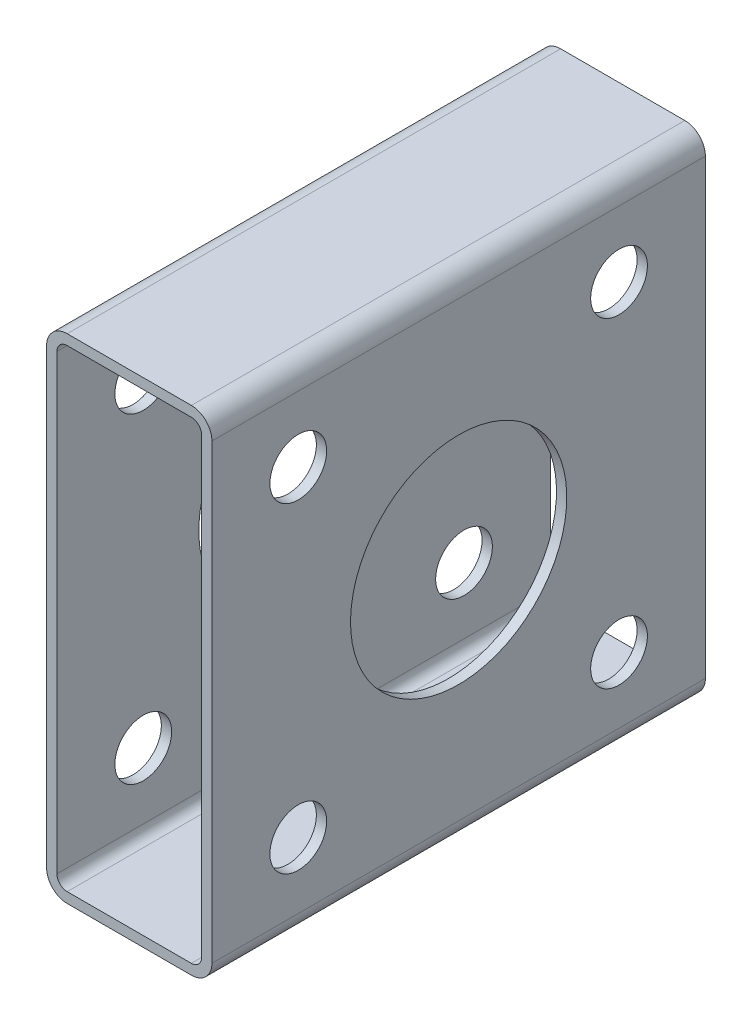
ISO-10303-21;
HEADER;
FILE_DESCRIPTION(('STEP AP214'),'2;1');
FILE_NAME('part.step','',(''),(''),'','','');
FILE_SCHEMA(('AUTOMOTIVE_DESIGN { 1 0 10303 214 1 1 1 1 }'));
ENDSEC;
DATA;
#1=APPLICATION_CONTEXT('core data for automotive mechanical design processes');
#2=APPLICATION_PROTOCOL_DEFINITION('international standard','automotive_design',2000,#1);
#3=PRODUCT_CONTEXT('',#1,'mechanical');
#4=PRODUCT('Part','Part','',(#3));
#5=PRODUCT_RELATED_PRODUCT_CATEGORY('part','',(#4));
#6=PRODUCT_DEFINITION_FORMATION('','',#4);
#7=PRODUCT_DEFINITION_CONTEXT('part definition',#1,'design');
#8=PRODUCT_DEFINITION('design','',#6,#7);
#9=PRODUCT_DEFINITION_SHAPE('','',#8);
#10=(LENGTH_UNIT() NAMED_UNIT(*) SI_UNIT(.MILLI.,.METRE.));
#11=(NAMED_UNIT(*) PLANE_ANGLE_UNIT() SI_UNIT($,.RADIAN.));
#12=(NAMED_UNIT(*) SI_UNIT($,.STERADIAN.) SOLID_ANGLE_UNIT());
#13=UNCERTAINTY_MEASURE_WITH_UNIT(LENGTH_MEASURE(1.E-05),#10,'distance_accuracy_value','');
#14=(GEOMETRIC_REPRESENTATION_CONTEXT(3) GLOBAL_UNCERTAINTY_ASSIGNED_CONTEXT((#13)) GLOBAL_UNIT_ASSIGNED_CONTEXT((#10,
#11,#12)) REPRESENTATION_CONTEXT('',''));
#15=CARTESIAN_POINT('',(0.,0.,0.));
#16=DIRECTION('',(0.,0.,1.));
#17=DIRECTION('',(1.,0.,0.));
#18=AXIS2_PLACEMENT_3D('',#15,#16,#17);
#19=CARTESIAN_POINT('',(-31.75,-69.85,152.4));
#20=DIRECTION('',(0.,0.,1.));
#21=DIRECTION('',(1.,0.,0.));
#22=AXIS2_PLACEMENT_3D('',#19,#20,#21);
#23=PLANE('',#22);
#24=CARTESIAN_POINT('',(-31.75,-69.85,152.4));
#25=DIRECTION('',(0.,0.,1.));
#26=DIRECTION('',(1.,0.,0.));
#27=AXIS2_PLACEMENT_3D('',#24,#25,#26);
#28=CIRCLE('',#27,6.35);
#29=CARTESIAN_POINT('',(-38.1,-69.85,152.4));
#30=VERTEX_POINT('',#29);
#31=CARTESIAN_POINT('',(-31.75,-76.2,152.4));
#32=VERTEX_POINT('',#31);
#33=EDGE_CURVE('E210',#30,#32,#28,.T.);
#34=ORIENTED_EDGE('',*,*,#33,.T.);
#35=DIRECTION('',(1.,0.,0.));
#36=VECTOR('',#35,1.);
#37=CARTESIAN_POINT('',(-31.75,-76.2,152.4));
#38=LINE('',#37,#36);
#39=CARTESIAN_POINT('',(6.60399999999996,-76.2,152.4));
#40=VERTEX_POINT('',#39);
#41=EDGE_CURVE('E213',#32,#40,#38,.T.);
#42=ORIENTED_EDGE('',*,*,#41,.T.);
#43=CARTESIAN_POINT('',(6.60399999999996,-69.85,152.4));
#44=DIRECTION('',(0.,0.,1.));
#45=DIRECTION('',(-1.,0.,0.));
#46=AXIS2_PLACEMENT_3D('',#43,#44,#45);
#47=CIRCLE('',#46,6.34999999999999);
#48=CARTESIAN_POINT('',(12.954,-69.85,152.4));
#49=VERTEX_POINT('',#48);
#50=EDGE_CURVE('E216',#40,#49,#47,.T.);
#51=ORIENTED_EDGE('',*,*,#50,.T.);
#52=DIRECTION('',(0.,1.,0.));
#53=VECTOR('',#52,1.);
#54=CARTESIAN_POINT('',(12.954,-69.85,152.4));
#55=LINE('',#54,#53);
#56=CARTESIAN_POINT('',(12.954,69.85,152.4));
#57=VERTEX_POINT('',#56);
#58=EDGE_CURVE('E218',#49,#57,#55,.T.);
#59=ORIENTED_EDGE('',*,*,#58,.T.);
#60=CARTESIAN_POINT('',(6.60399999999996,69.85,152.4));
#61=DIRECTION('',(0.,0.,1.));
#62=DIRECTION('',(1.,0.,0.));
#63=AXIS2_PLACEMENT_3D('',#60,#61,#62);
#64=CIRCLE('',#63,6.35);
#65=CARTESIAN_POINT('',(6.60399999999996,76.2,152.4));
#66=VERTEX_POINT('',#65);
#67=EDGE_CURVE('E220',#57,#66,#64,.T.);
#68=ORIENTED_EDGE('',*,*,#67,.T.);
#69=DIRECTION('',(-1.,0.,0.));
#70=VECTOR('',#69,1.);
#71=CARTESIAN_POINT('',(-31.75,76.2,152.4));
#72=LINE('',#71,#70);
#73=CARTESIAN_POINT('',(-31.75,76.2,152.4));
#74=VERTEX_POINT('',#73);
#75=EDGE_CURVE('E222',#66,#74,#72,.T.);
#76=ORIENTED_EDGE('',*,*,#75,.T.);
#77=CARTESIAN_POINT('',(-31.75,69.85,152.4));
#78=DIRECTION('',(0.,0.,1.));
#79=DIRECTION('',(1.,0.,0.));
#80=AXIS2_PLACEMENT_3D('',#77,#78,#79);
#81=CIRCLE('',#80,6.34999999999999);
#82=CARTESIAN_POINT('',(-38.1,69.85,152.4));
#83=VERTEX_POINT('',#82);
#84=EDGE_CURVE('E224',#74,#83,#81,.T.);
#85=ORIENTED_EDGE('',*,*,#84,.T.);
#86=DIRECTION('',(0.,-1.,0.));
#87=VECTOR('',#86,1.);
#88=CARTESIAN_POINT('',(-38.1,-69.85,152.4));
#89=LINE('',#88,#87);
#90=EDGE_CURVE('E226',#83,#30,#89,.T.);
#91=ORIENTED_EDGE('',*,*,#90,.T.);
#92=EDGE_LOOP('',(#34,#42,#51,#59,#68,#76,#85,#91));
#93=FACE_BOUND('',#92,.T.);
#94=DIRECTION('',(1.,0.,0.));
#95=VECTOR('',#94,1.);
#96=CARTESIAN_POINT('',(-31.75,-73.025,152.4));
#97=LINE('',#96,#95);
#98=CARTESIAN_POINT('',(-31.75,-73.025,152.4));
#99=VERTEX_POINT('',#98);
#100=CARTESIAN_POINT('',(6.60399999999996,-73.025,152.4));
#101=VERTEX_POINT('',#100);
#102=EDGE_CURVE('E151',#99,#101,#97,.T.);
#103=ORIENTED_EDGE('',*,*,#102,.F.);
#104=CARTESIAN_POINT('',(-31.75,-69.85,152.4));
#105=DIRECTION('',(0.,0.,1.));
#106=DIRECTION('',(1.,0.,0.));
#107=AXIS2_PLACEMENT_3D('',#104,#105,#106);
#108=CIRCLE('',#107,3.17500000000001);
#109=CARTESIAN_POINT('',(-34.925,-69.85,152.4));
#110=VERTEX_POINT('',#109);
#111=EDGE_CURVE('E143',#110,#99,#108,.T.);
#112=ORIENTED_EDGE('',*,*,#111,.F.);
#113=DIRECTION('',(0.,-1.,0.));
#114=VECTOR('',#113,1.);
#115=CARTESIAN_POINT('',(-34.925,-69.85,152.4));
#116=LINE('',#115,#114);
#117=CARTESIAN_POINT('',(-34.925,69.85,152.4));
#118=VERTEX_POINT('',#117);
#119=EDGE_CURVE('E177',#118,#110,#116,.T.);
#120=ORIENTED_EDGE('',*,*,#119,.F.);
#121=CARTESIAN_POINT('',(-31.75,69.85,152.4));
#122=DIRECTION('',(0.,0.,1.));
#123=DIRECTION('',(1.,0.,0.));
#124=AXIS2_PLACEMENT_3D('',#121,#122,#123);
#125=CIRCLE('',#124,3.175);
#126=CARTESIAN_POINT('',(-31.75,73.025,152.4));
#127=VERTEX_POINT('',#126);
#128=EDGE_CURVE('E175',#127,#118,#125,.T.);
#129=ORIENTED_EDGE('',*,*,#128,.F.);
#130=DIRECTION('',(-1.,0.,0.));
#131=VECTOR('',#130,1.);
#132=CARTESIAN_POINT('',(-31.75,73.025,152.4));
#133=LINE('',#132,#131);
#134=CARTESIAN_POINT('',(6.60399999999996,73.025,152.4));
#135=VERTEX_POINT('',#134);
#136=EDGE_CURVE('E173',#135,#127,#133,.T.);
#137=ORIENTED_EDGE('',*,*,#136,.F.);
#138=CARTESIAN_POINT('',(6.60399999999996,69.85,152.4));
#139=DIRECTION('',(0.,0.,1.));
#140=DIRECTION('',(1.,0.,0.));
#141=AXIS2_PLACEMENT_3D('',#138,#139,#140);
#142=CIRCLE('',#141,3.175);
#143=CARTESIAN_POINT('',(9.77899999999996,69.85,152.4));
#144=VERTEX_POINT('',#143);
#145=EDGE_CURVE('E171',#144,#135,#142,.T.);
#146=ORIENTED_EDGE('',*,*,#145,.F.);
#147=DIRECTION('',(0.,1.,0.));
#148=VECTOR('',#147,1.);
#149=CARTESIAN_POINT('',(9.77899999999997,-69.85,152.4));
#150=LINE('',#149,#148);
#151=CARTESIAN_POINT('',(9.77899999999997,-69.85,152.4));
#152=VERTEX_POINT('',#151);
#153=EDGE_CURVE('E166',#152,#144,#150,.T.);
#154=ORIENTED_EDGE('',*,*,#153,.F.);
#155=CARTESIAN_POINT('',(6.60399999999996,-69.85,152.4));
#156=DIRECTION('',(0.,0.,1.));
#157=DIRECTION('',(-1.,0.,0.));
#158=AXIS2_PLACEMENT_3D('',#155,#156,#157);
#159=CIRCLE('',#158,3.17499999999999);
#160=EDGE_CURVE('E164',#101,#152,#159,.T.);
#161=ORIENTED_EDGE('',*,*,#160,.F.);
#162=EDGE_LOOP('',(#103,#112,#120,#129,#137,#146,#154,#161));
#163=FACE_BOUND('',#162,.T.);
#164=ADVANCED_FACE('F30',(#93,#163),#23,.T.);
#165=CARTESIAN_POINT('',(-31.75,-69.85,0.));
#166=DIRECTION('',(0.,0.,1.));
#167=DIRECTION('',(1.,0.,0.));
#168=AXIS2_PLACEMENT_3D('',#165,#166,#167);
#169=PLANE('',#168);
#170=CARTESIAN_POINT('',(-31.75,-69.85,0.));
#171=DIRECTION('',(0.,0.,1.));
#172=DIRECTION('',(1.,0.,0.));
#173=AXIS2_PLACEMENT_3D('',#170,#171,#172);
#174=CIRCLE('',#173,6.35);
#175=CARTESIAN_POINT('',(-38.1,-69.85,0.));
#176=VERTEX_POINT('',#175);
#177=CARTESIAN_POINT('',(-31.75,-76.2,0.));
#178=VERTEX_POINT('',#177);
#179=EDGE_CURVE('E159',#176,#178,#174,.T.);
#180=ORIENTED_EDGE('',*,*,#179,.F.);
#181=DIRECTION('',(0.,-1.,0.));
#182=VECTOR('',#181,1.);
#183=CARTESIAN_POINT('',(-38.1,-69.85,0.));
#184=LINE('',#183,#182);
#185=CARTESIAN_POINT('',(-38.1,69.85,0.));
#186=VERTEX_POINT('',#185);
#187=EDGE_CURVE('E214',#186,#176,#184,.T.);
#188=ORIENTED_EDGE('',*,*,#187,.F.);
#189=CARTESIAN_POINT('',(-31.75,69.85,0.));
#190=DIRECTION('',(0.,0.,1.));
#191=DIRECTION('',(1.,0.,0.));
#192=AXIS2_PLACEMENT_3D('',#189,#190,#191);
#193=CIRCLE('',#192,6.34999999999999);
#194=CARTESIAN_POINT('',(-31.75,76.2,0.));
#195=VERTEX_POINT('',#194);
#196=EDGE_CURVE('E241',#195,#186,#193,.T.);
#197=ORIENTED_EDGE('',*,*,#196,.F.);
#198=DIRECTION('',(-1.,0.,0.));
#199=VECTOR('',#198,1.);
#200=CARTESIAN_POINT('',(-31.75,76.2,0.));
#201=LINE('',#200,#199);
#202=CARTESIAN_POINT('',(6.60399999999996,76.2,0.));
#203=VERTEX_POINT('',#202);
#204=EDGE_CURVE('E239',#203,#195,#201,.T.);
#205=ORIENTED_EDGE('',*,*,#204,.F.);
#206=CARTESIAN_POINT('',(6.60399999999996,69.85,0.));
#207=DIRECTION('',(0.,0.,1.));
#208=DIRECTION('',(1.,0.,0.));
#209=AXIS2_PLACEMENT_3D('',#206,#207,#208);
#210=CIRCLE('',#209,6.35);
#211=CARTESIAN_POINT('',(12.954,69.85,0.));
#212=VERTEX_POINT('',#211);
#213=EDGE_CURVE('E237',#212,#203,#210,.T.);
#214=ORIENTED_EDGE('',*,*,#213,.F.);
#215=DIRECTION('',(0.,1.,0.));
#216=VECTOR('',#215,1.);
#217=CARTESIAN_POINT('',(12.954,-69.85,0.));
#218=LINE('',#217,#216);
#219=CARTESIAN_POINT('',(12.954,-69.85,0.));
#220=VERTEX_POINT('',#219);
#221=EDGE_CURVE('E235',#220,#212,#218,.T.);
#222=ORIENTED_EDGE('',*,*,#221,.F.);
#223=CARTESIAN_POINT('',(6.60399999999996,-69.85,0.));
#224=DIRECTION('',(0.,0.,1.));
#225=DIRECTION('',(-1.,0.,0.));
#226=AXIS2_PLACEMENT_3D('',#223,#224,#225);
#227=CIRCLE('',#226,6.34999999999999);
#228=CARTESIAN_POINT('',(6.60399999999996,-76.2,0.));
#229=VERTEX_POINT('',#228);
#230=EDGE_CURVE('E233',#229,#220,#227,.T.);
#231=ORIENTED_EDGE('',*,*,#230,.F.);
#232=DIRECTION('',(1.,0.,0.));
#233=VECTOR('',#232,1.);
#234=CARTESIAN_POINT('',(-31.75,-76.2,0.));
#235=LINE('',#234,#233);
#236=EDGE_CURVE('E231',#178,#229,#235,.T.);
#237=ORIENTED_EDGE('',*,*,#236,.F.);
#238=EDGE_LOOP('',(#180,#188,#197,#205,#214,#222,#231,#237));
#239=FACE_BOUND('',#238,.T.);
#240=CARTESIAN_POINT('',(-31.75,-69.85,0.));
#241=DIRECTION('',(0.,0.,1.));
#242=DIRECTION('',(1.,0.,0.));
#243=AXIS2_PLACEMENT_3D('',#240,#241,#242);
#244=CIRCLE('',#243,3.17500000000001);
#245=CARTESIAN_POINT('',(-34.925,-69.85,0.));
#246=VERTEX_POINT('',#245);
#247=CARTESIAN_POINT('',(-31.75,-73.025,0.));
#248=VERTEX_POINT('',#247);
#249=EDGE_CURVE('E53',#246,#248,#244,.T.);
#250=ORIENTED_EDGE('',*,*,#249,.T.);
#251=DIRECTION('',(1.,0.,0.));
#252=VECTOR('',#251,1.);
#253=CARTESIAN_POINT('',(-31.75,-73.025,0.));
#254=LINE('',#253,#252);
#255=CARTESIAN_POINT('',(6.60399999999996,-73.025,0.));
#256=VERTEX_POINT('',#255);
#257=EDGE_CURVE('E158',#248,#256,#254,.T.);
#258=ORIENTED_EDGE('',*,*,#257,.T.);
#259=CARTESIAN_POINT('',(6.60399999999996,-69.85,0.));
#260=DIRECTION('',(0.,0.,1.));
#261=DIRECTION('',(-1.,0.,0.));
#262=AXIS2_PLACEMENT_3D('',#259,#260,#261);
#263=CIRCLE('',#262,3.17499999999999);
#264=CARTESIAN_POINT('',(9.77899999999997,-69.85,0.));
#265=VERTEX_POINT('',#264);
#266=EDGE_CURVE('E182',#256,#265,#263,.T.);
#267=ORIENTED_EDGE('',*,*,#266,.T.);
#268=DIRECTION('',(0.,1.,0.));
#269=VECTOR('',#268,1.);
#270=CARTESIAN_POINT('',(9.77899999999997,-69.85,0.));
#271=LINE('',#270,#269);
#272=CARTESIAN_POINT('',(9.77899999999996,69.85,0.));
#273=VERTEX_POINT('',#272);
#274=EDGE_CURVE('E185',#265,#273,#271,.T.);
#275=ORIENTED_EDGE('',*,*,#274,.T.);
#276=CARTESIAN_POINT('',(6.60399999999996,69.85,0.));
#277=DIRECTION('',(0.,0.,1.));
#278=DIRECTION('',(1.,0.,0.));
#279=AXIS2_PLACEMENT_3D('',#276,#277,#278);
#280=CIRCLE('',#279,3.175);
#281=CARTESIAN_POINT('',(6.60399999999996,73.025,0.));
#282=VERTEX_POINT('',#281);
#283=EDGE_CURVE('E188',#273,#282,#280,.T.);
#284=ORIENTED_EDGE('',*,*,#283,.T.);
#285=DIRECTION('',(-1.,0.,0.));
#286=VECTOR('',#285,1.);
#287=CARTESIAN_POINT('',(-31.75,73.025,0.));
#288=LINE('',#287,#286);
#289=CARTESIAN_POINT('',(-31.75,73.025,0.));
#290=VERTEX_POINT('',#289);
#291=EDGE_CURVE('E191',#282,#290,#288,.T.);
#292=ORIENTED_EDGE('',*,*,#291,.T.);
#293=CARTESIAN_POINT('',(-31.75,69.85,0.));
#294=DIRECTION('',(0.,0.,1.));
#295=DIRECTION('',(1.,0.,0.));
#296=AXIS2_PLACEMENT_3D('',#293,#294,#295);
#297=CIRCLE('',#296,3.175);
#298=CARTESIAN_POINT('',(-34.925,69.85,0.));
#299=VERTEX_POINT('',#298);
#300=EDGE_CURVE('E194',#290,#299,#297,.T.);
#301=ORIENTED_EDGE('',*,*,#300,.T.);
#302=DIRECTION('',(0.,-1.,0.));
#303=VECTOR('',#302,1.);
#304=CARTESIAN_POINT('',(-34.925,-69.85,0.));
#305=LINE('',#304,#303);
#306=EDGE_CURVE('E152',#299,#246,#305,.T.);
#307=ORIENTED_EDGE('',*,*,#306,.T.);
#308=EDGE_LOOP('',(#250,#258,#267,#275,#284,#292,#301,#307));
#309=FACE_BOUND('',#308,.T.);
#310=ADVANCED_FACE('F271',(#239,#309),#169,.F.);
#311=CARTESIAN_POINT('',(-31.75,-69.85,152.4));
#312=DIRECTION('',(0.,0.,-1.));
#313=DIRECTION('',(-1.,0.,0.));
#314=AXIS2_PLACEMENT_3D('',#311,#312,#313);
#315=CYLINDRICAL_SURFACE('',#314,6.35);
#316=ORIENTED_EDGE('',*,*,#179,.T.);
#317=DIRECTION('',(0.,0.,-1.));
#318=VECTOR('',#317,1.);
#319=CARTESIAN_POINT('',(-31.75,-76.2,152.4));
#320=LINE('',#319,#318);
#321=EDGE_CURVE('E11',#32,#178,#320,.T.);
#322=ORIENTED_EDGE('',*,*,#321,.F.);
#323=ORIENTED_EDGE('',*,*,#33,.F.);
#324=DIRECTION('',(0.,0.,-1.));
#325=VECTOR('',#324,1.);
#326=CARTESIAN_POINT('',(-38.1,-69.85,152.4));
#327=LINE('',#326,#325);
#328=EDGE_CURVE('E228',#30,#176,#327,.T.);
#329=ORIENTED_EDGE('',*,*,#328,.T.);
#330=EDGE_LOOP('',(#316,#322,#323,#329));
#331=FACE_BOUND('',#330,.T.);
#332=ADVANCED_FACE('F32',(#331),#315,.T.);
#333=CARTESIAN_POINT('',(-31.75,-76.2,152.4));
#334=DIRECTION('',(0.,1.,0.));
#335=DIRECTION('',(-1.,0.,0.));
#336=AXIS2_PLACEMENT_3D('',#333,#334,#335);
#337=PLANE('',#336);
#338=ORIENTED_EDGE('',*,*,#236,.T.);
#339=DIRECTION('',(0.,0.,-1.));
#340=VECTOR('',#339,1.);
#341=CARTESIAN_POINT('',(6.60399999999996,-76.2,152.4));
#342=LINE('',#341,#340);
#343=EDGE_CURVE('E38',#40,#229,#342,.T.);
#344=ORIENTED_EDGE('',*,*,#343,.F.);
#345=ORIENTED_EDGE('',*,*,#41,.F.);
#346=ORIENTED_EDGE('',*,*,#321,.T.);
#347=EDGE_LOOP('',(#338,#344,#345,#346));
#348=FACE_BOUND('',#347,.T.);
#349=ADVANCED_FACE('F288',(#348),#337,.F.);
#350=CARTESIAN_POINT('',(6.60399999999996,-69.85,152.4));
#351=DIRECTION('',(0.,0.,-1.));
#352=DIRECTION('',(-1.,0.,0.));
#353=AXIS2_PLACEMENT_3D('',#350,#351,#352);
#354=CYLINDRICAL_SURFACE('',#353,6.34999999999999);
#355=ORIENTED_EDGE('',*,*,#230,.T.);
#356=DIRECTION('',(0.,0.,-1.));
#357=VECTOR('',#356,1.);
#358=CARTESIAN_POINT('',(12.954,-69.85,152.4));
#359=LINE('',#358,#357);
#360=EDGE_CURVE('E258',#49,#220,#359,.T.);
#361=ORIENTED_EDGE('',*,*,#360,.F.);
#362=ORIENTED_EDGE('',*,*,#50,.F.);
#363=ORIENTED_EDGE('',*,*,#343,.T.);
#364=EDGE_LOOP('',(#355,#361,#362,#363));
#365=FACE_BOUND('',#364,.T.);
#366=ADVANCED_FACE('F265',(#365),#354,.T.);
#367=CARTESIAN_POINT('',(12.954,-69.85,152.4));
#368=DIRECTION('',(-1.,0.,0.));
#369=DIRECTION('',(0.,0.,1.));
#370=AXIS2_PLACEMENT_3D('',#367,#368,#369);
#371=PLANE('',#370);
#372=CARTESIAN_POINT('',(12.954,-49.53,26.67));
#373=DIRECTION('',(1.,0.,0.));
#374=DIRECTION('',(0.,1.,0.));
#375=AXIS2_PLACEMENT_3D('',#372,#373,#374);
#376=CIRCLE('',#375,8.76299999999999);
#377=CARTESIAN_POINT('',(12.954,-40.767,26.67));
#378=VERTEX_POINT('',#377);
#379=EDGE_CURVE('E348',#378,#378,#376,.T.);
#380=ORIENTED_EDGE('',*,*,#379,.F.);
#381=EDGE_LOOP('',(#380));
#382=FACE_BOUND('',#381,.T.);
#383=CARTESIAN_POINT('',(12.954,-49.53,125.73));
#384=DIRECTION('',(1.,0.,0.));
#385=DIRECTION('',(0.,1.,0.));
#386=AXIS2_PLACEMENT_3D('',#383,#384,#385);
#387=CIRCLE('',#386,8.76299999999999);
#388=CARTESIAN_POINT('',(12.954,-40.767,125.73));
#389=VERTEX_POINT('',#388);
#390=EDGE_CURVE('E361',#389,#389,#387,.T.);
#391=ORIENTED_EDGE('',*,*,#390,.F.);
#392=EDGE_LOOP('',(#391));
#393=FACE_BOUND('',#392,.T.);
#394=CARTESIAN_POINT('',(12.954,49.53,26.67));
#395=DIRECTION('',(1.,0.,0.));
#396=DIRECTION('',(0.,1.,0.));
#397=AXIS2_PLACEMENT_3D('',#394,#395,#396);
#398=CIRCLE('',#397,8.76299999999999);
#399=CARTESIAN_POINT('',(12.954,58.293,26.67));
#400=VERTEX_POINT('',#399);
#401=EDGE_CURVE('E367',#400,#400,#398,.T.);
#402=ORIENTED_EDGE('',*,*,#401,.F.);
#403=EDGE_LOOP('',(#402));
#404=FACE_BOUND('',#403,.T.);
#405=CARTESIAN_POINT('',(12.954,49.53,125.73));
#406=DIRECTION('',(1.,0.,0.));
#407=DIRECTION('',(0.,1.,0.));
#408=AXIS2_PLACEMENT_3D('',#405,#406,#407);
#409=CIRCLE('',#408,8.76299999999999);
#410=CARTESIAN_POINT('',(12.954,58.293,125.73));
#411=VERTEX_POINT('',#410);
#412=EDGE_CURVE('E373',#411,#411,#409,.T.);
#413=ORIENTED_EDGE('',*,*,#412,.F.);
#414=EDGE_LOOP('',(#413));
#415=FACE_BOUND('',#414,.T.);
#416=CARTESIAN_POINT('',(12.954,0.,76.2));
#417=DIRECTION('',(1.,0.,0.));
#418=DIRECTION('',(0.,1.,0.));
#419=AXIS2_PLACEMENT_3D('',#416,#417,#418);
#420=CIRCLE('',#419,33.3953044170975);
#421=CARTESIAN_POINT('',(12.954,33.3953044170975,76.2));
#422=VERTEX_POINT('',#421);
#423=EDGE_CURVE('E180',#422,#422,#420,.T.);
#424=ORIENTED_EDGE('',*,*,#423,.F.);
#425=EDGE_LOOP('',(#424));
#426=FACE_BOUND('',#425,.T.);
#427=ORIENTED_EDGE('',*,*,#221,.T.);
#428=DIRECTION('',(0.,0.,-1.));
#429=VECTOR('',#428,1.);
#430=CARTESIAN_POINT('',(12.954,69.85,152.4));
#431=LINE('',#430,#429);
#432=EDGE_CURVE('E255',#57,#212,#431,.T.);
#433=ORIENTED_EDGE('',*,*,#432,.F.);
#434=ORIENTED_EDGE('',*,*,#58,.F.);
#435=ORIENTED_EDGE('',*,*,#360,.T.);
#436=EDGE_LOOP('',(#427,#433,#434,#435));
#437=FACE_BOUND('',#436,.T.);
#438=ADVANCED_FACE('F277',(#382,#393,#404,#415,#426,#437),#371,.F.);
#439=CARTESIAN_POINT('',(6.60399999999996,69.85,152.4));
#440=DIRECTION('',(0.,0.,-1.));
#441=DIRECTION('',(-1.,0.,0.));
#442=AXIS2_PLACEMENT_3D('',#439,#440,#441);
#443=CYLINDRICAL_SURFACE('',#442,6.35);
#444=ORIENTED_EDGE('',*,*,#213,.T.);
#445=DIRECTION('',(0.,0.,-1.));
#446=VECTOR('',#445,1.);
#447=CARTESIAN_POINT('',(6.60399999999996,76.2,152.4));
#448=LINE('',#447,#446);
#449=EDGE_CURVE('E252',#66,#203,#448,.T.);
#450=ORIENTED_EDGE('',*,*,#449,.F.);
#451=ORIENTED_EDGE('',*,*,#67,.F.);
#452=ORIENTED_EDGE('',*,*,#432,.T.);
#453=EDGE_LOOP('',(#444,#450,#451,#452));
#454=FACE_BOUND('',#453,.T.);
#455=ADVANCED_FACE('F281',(#454),#443,.T.);
#456=CARTESIAN_POINT('',(-31.75,76.2,152.4));
#457=DIRECTION('',(0.,-1.,0.));
#458=DIRECTION('',(0.,0.,-1.));
#459=AXIS2_PLACEMENT_3D('',#456,#457,#458);
#460=PLANE('',#459);
#461=ORIENTED_EDGE('',*,*,#204,.T.);
#462=DIRECTION('',(0.,0.,-1.));
#463=VECTOR('',#462,1.);
#464=CARTESIAN_POINT('',(-31.75,76.2,152.4));
#465=LINE('',#464,#463);
#466=EDGE_CURVE('E249',#74,#195,#465,.T.);
#467=ORIENTED_EDGE('',*,*,#466,.F.);
#468=ORIENTED_EDGE('',*,*,#75,.F.);
#469=ORIENTED_EDGE('',*,*,#449,.T.);
#470=EDGE_LOOP('',(#461,#467,#468,#469));
#471=FACE_BOUND('',#470,.T.);
#472=ADVANCED_FACE('F301',(#471),#460,.F.);
#473=CARTESIAN_POINT('',(-31.75,69.85,152.4));
#474=DIRECTION('',(0.,0.,-1.));
#475=DIRECTION('',(-1.,0.,0.));
#476=AXIS2_PLACEMENT_3D('',#473,#474,#475);
#477=CYLINDRICAL_SURFACE('',#476,6.34999999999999);
#478=ORIENTED_EDGE('',*,*,#196,.T.);
#479=DIRECTION('',(0.,0.,-1.));
#480=VECTOR('',#479,1.);
#481=CARTESIAN_POINT('',(-38.1,69.85,152.4));
#482=LINE('',#481,#480);
#483=EDGE_CURVE('E246',#83,#186,#482,.T.);
#484=ORIENTED_EDGE('',*,*,#483,.F.);
#485=ORIENTED_EDGE('',*,*,#84,.F.);
#486=ORIENTED_EDGE('',*,*,#466,.T.);
#487=EDGE_LOOP('',(#478,#484,#485,#486));
#488=FACE_BOUND('',#487,.T.);
#489=ADVANCED_FACE('F299',(#488),#477,.T.);
#490=CARTESIAN_POINT('',(-38.1,-69.85,152.4));
#491=DIRECTION('',(1.,0.,0.));
#492=DIRECTION('',(0.,1.,0.));
#493=AXIS2_PLACEMENT_3D('',#490,#491,#492);
#494=PLANE('',#493);
#495=CARTESIAN_POINT('',(-38.1,-49.53,125.73));
#496=DIRECTION('',(-1.,0.,0.));
#497=DIRECTION('',(0.,-1.,0.));
#498=AXIS2_PLACEMENT_3D('',#495,#496,#497);
#499=CIRCLE('',#498,8.76299999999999);
#500=CARTESIAN_POINT('',(-38.1,-58.2929999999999,125.73));
#501=VERTEX_POINT('',#500);
#502=EDGE_CURVE('E327',#501,#501,#499,.T.);
#503=ORIENTED_EDGE('',*,*,#502,.F.);
#504=EDGE_LOOP('',(#503));
#505=FACE_BOUND('',#504,.T.);
#506=CARTESIAN_POINT('',(-38.1,-49.53,26.67));
#507=DIRECTION('',(-1.,0.,0.));
#508=DIRECTION('',(0.,-1.,0.));
#509=AXIS2_PLACEMENT_3D('',#506,#507,#508);
#510=CIRCLE('',#509,8.76299999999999);
#511=CARTESIAN_POINT('',(-38.1,-58.2929999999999,26.67));
#512=VERTEX_POINT('',#511);
#513=EDGE_CURVE('E331',#512,#512,#510,.T.);
#514=ORIENTED_EDGE('',*,*,#513,.F.);
#515=EDGE_LOOP('',(#514));
#516=FACE_BOUND('',#515,.T.);
#517=CARTESIAN_POINT('',(-38.1,49.53,125.73));
#518=DIRECTION('',(-1.,0.,0.));
#519=DIRECTION('',(0.,-1.,0.));
#520=AXIS2_PLACEMENT_3D('',#517,#518,#519);
#521=CIRCLE('',#520,8.76299999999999);
#522=CARTESIAN_POINT('',(-38.1,40.7670000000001,125.73));
#523=VERTEX_POINT('',#522);
#524=EDGE_CURVE('E335',#523,#523,#521,.T.);
#525=ORIENTED_EDGE('',*,*,#524,.F.);
#526=EDGE_LOOP('',(#525));
#527=FACE_BOUND('',#526,.T.);
#528=CARTESIAN_POINT('',(-38.1,49.53,26.67));
#529=DIRECTION('',(-1.,0.,0.));
#530=DIRECTION('',(0.,-1.,0.));
#531=AXIS2_PLACEMENT_3D('',#528,#529,#530);
#532=CIRCLE('',#531,8.76299999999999);
#533=CARTESIAN_POINT('',(-38.1,40.7670000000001,26.67));
#534=VERTEX_POINT('',#533);
#535=EDGE_CURVE('E339',#534,#534,#532,.T.);
#536=ORIENTED_EDGE('',*,*,#535,.F.);
#537=EDGE_LOOP('',(#536));
#538=FACE_BOUND('',#537,.T.);
#539=CARTESIAN_POINT('',(-38.1,0.,76.2));
#540=DIRECTION('',(-1.,0.,0.));
#541=DIRECTION('',(0.,-1.,0.));
#542=AXIS2_PLACEMENT_3D('',#539,#540,#541);
#543=CIRCLE('',#542,32.385);
#544=CARTESIAN_POINT('',(-38.1,-32.385,76.2));
#545=VERTEX_POINT('',#544);
#546=EDGE_CURVE('E342',#545,#545,#543,.T.);
#547=ORIENTED_EDGE('',*,*,#546,.F.);
#548=EDGE_LOOP('',(#547));
#549=FACE_BOUND('',#548,.T.);
#550=ORIENTED_EDGE('',*,*,#187,.T.);
#551=ORIENTED_EDGE('',*,*,#328,.F.);
#552=ORIENTED_EDGE('',*,*,#90,.F.);
#553=ORIENTED_EDGE('',*,*,#483,.T.);
#554=EDGE_LOOP('',(#550,#551,#552,#553));
#555=FACE_BOUND('',#554,.T.);
#556=ADVANCED_FACE('F294',(#505,#516,#527,#538,#549,#555),#494,.F.);
#557=CARTESIAN_POINT('',(-31.75,-69.85,152.4));
#558=DIRECTION('',(0.,0.,-1.));
#559=DIRECTION('',(-1.,0.,0.));
#560=AXIS2_PLACEMENT_3D('',#557,#558,#559);
#561=CYLINDRICAL_SURFACE('',#560,3.17500000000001);
#562=ORIENTED_EDGE('',*,*,#249,.F.);
#563=DIRECTION('',(0.,0.,-1.));
#564=VECTOR('',#563,1.);
#565=CARTESIAN_POINT('',(-34.925,-69.85,152.4));
#566=LINE('',#565,#564);
#567=EDGE_CURVE('E147',#110,#246,#566,.T.);
#568=ORIENTED_EDGE('',*,*,#567,.F.);
#569=ORIENTED_EDGE('',*,*,#111,.T.);
#570=DIRECTION('',(0.,0.,-1.));
#571=VECTOR('',#570,1.);
#572=CARTESIAN_POINT('',(-31.75,-73.025,152.4));
#573=LINE('',#572,#571);
#574=EDGE_CURVE('E146',#99,#248,#573,.T.);
#575=ORIENTED_EDGE('',*,*,#574,.T.);
#576=EDGE_LOOP('',(#562,#568,#569,#575));
#577=FACE_BOUND('',#576,.T.);
#578=ADVANCED_FACE('F145',(#577),#561,.F.);
#579=CARTESIAN_POINT('',(-31.75,-73.025,152.4));
#580=DIRECTION('',(0.,1.,0.));
#581=DIRECTION('',(-1.,0.,0.));
#582=AXIS2_PLACEMENT_3D('',#579,#580,#581);
#583=PLANE('',#582);
#584=ORIENTED_EDGE('',*,*,#257,.F.);
#585=ORIENTED_EDGE('',*,*,#574,.F.);
#586=ORIENTED_EDGE('',*,*,#102,.T.);
#587=DIRECTION('',(0.,0.,-1.));
#588=VECTOR('',#587,1.);
#589=CARTESIAN_POINT('',(6.60399999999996,-73.025,152.4));
#590=LINE('',#589,#588);
#591=EDGE_CURVE('E160',#101,#256,#590,.T.);
#592=ORIENTED_EDGE('',*,*,#591,.T.);
#593=EDGE_LOOP('',(#584,#585,#586,#592));
#594=FACE_BOUND('',#593,.T.);
#595=ADVANCED_FACE('F155',(#594),#583,.T.);
#596=CARTESIAN_POINT('',(6.60399999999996,-69.85,152.4));
#597=DIRECTION('',(0.,0.,-1.));
#598=DIRECTION('',(-1.,0.,0.));
#599=AXIS2_PLACEMENT_3D('',#596,#597,#598);
#600=CYLINDRICAL_SURFACE('',#599,3.17499999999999);
#601=ORIENTED_EDGE('',*,*,#266,.F.);
#602=ORIENTED_EDGE('',*,*,#591,.F.);
#603=ORIENTED_EDGE('',*,*,#160,.T.);
#604=DIRECTION('',(0.,0.,-1.));
#605=VECTOR('',#604,1.);
#606=CARTESIAN_POINT('',(9.77899999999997,-69.85,152.4));
#607=LINE('',#606,#605);
#608=EDGE_CURVE('E207',#152,#265,#607,.T.);
#609=ORIENTED_EDGE('',*,*,#608,.T.);
#610=EDGE_LOOP('',(#601,#602,#603,#609));
#611=FACE_BOUND('',#610,.T.);
#612=ADVANCED_FACE('F458',(#611),#600,.F.);
#613=CARTESIAN_POINT('',(9.77899999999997,-69.85,152.4));
#614=DIRECTION('',(-1.,0.,0.));
#615=DIRECTION('',(0.,0.,1.));
#616=AXIS2_PLACEMENT_3D('',#613,#614,#615);
#617=PLANE('',#616);
#618=CARTESIAN_POINT('',(9.77899999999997,-49.53,26.67));
#619=DIRECTION('',(-1.,0.,0.));
#620=DIRECTION('',(0.,0.,1.));
#621=AXIS2_PLACEMENT_3D('',#618,#619,#620);
#622=CIRCLE('',#621,8.76299999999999);
#623=CARTESIAN_POINT('',(9.77899999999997,-49.53,35.433));
#624=VERTEX_POINT('',#623);
#625=EDGE_CURVE('E344',#624,#624,#622,.F.);
#626=ORIENTED_EDGE('',*,*,#625,.T.);
#627=EDGE_LOOP('',(#626));
#628=FACE_BOUND('',#627,.T.);
#629=CARTESIAN_POINT('',(9.77899999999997,-49.53,125.73));
#630=DIRECTION('',(-1.,0.,0.));
#631=DIRECTION('',(0.,0.,1.));
#632=AXIS2_PLACEMENT_3D('',#629,#630,#631);
#633=CIRCLE('',#632,8.76299999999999);
#634=CARTESIAN_POINT('',(9.77899999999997,-49.53,134.493));
#635=VERTEX_POINT('',#634);
#636=EDGE_CURVE('E358',#635,#635,#633,.F.);
#637=ORIENTED_EDGE('',*,*,#636,.T.);
#638=EDGE_LOOP('',(#637));
#639=FACE_BOUND('',#638,.T.);
#640=CARTESIAN_POINT('',(9.77899999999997,49.53,26.67));
#641=DIRECTION('',(-1.,0.,0.));
#642=DIRECTION('',(0.,0.,1.));
#643=AXIS2_PLACEMENT_3D('',#640,#641,#642);
#644=CIRCLE('',#643,8.76299999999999);
#645=CARTESIAN_POINT('',(9.77899999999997,49.53,35.433));
#646=VERTEX_POINT('',#645);
#647=EDGE_CURVE('E364',#646,#646,#644,.F.);
#648=ORIENTED_EDGE('',*,*,#647,.T.);
#649=EDGE_LOOP('',(#648));
#650=FACE_BOUND('',#649,.T.);
#651=CARTESIAN_POINT('',(9.77899999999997,49.53,125.73));
#652=DIRECTION('',(-1.,0.,0.));
#653=DIRECTION('',(0.,0.,1.));
#654=AXIS2_PLACEMENT_3D('',#651,#652,#653);
#655=CIRCLE('',#654,8.76299999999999);
#656=CARTESIAN_POINT('',(9.77899999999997,49.53,134.493));
#657=VERTEX_POINT('',#656);
#658=EDGE_CURVE('E370',#657,#657,#655,.F.);
#659=ORIENTED_EDGE('',*,*,#658,.T.);
#660=EDGE_LOOP('',(#659));
#661=FACE_BOUND('',#660,.T.);
#662=CARTESIAN_POINT('',(9.77899999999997,0.,76.2));
#663=DIRECTION('',(-1.,0.,0.));
#664=DIRECTION('',(0.,0.,1.));
#665=AXIS2_PLACEMENT_3D('',#662,#663,#664);
#666=CIRCLE('',#665,33.3953044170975);
#667=CARTESIAN_POINT('',(9.77899999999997,0.,109.595304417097));
#668=VERTEX_POINT('',#667);
#669=EDGE_CURVE('E376',#668,#668,#666,.F.);
#670=ORIENTED_EDGE('',*,*,#669,.T.);
#671=EDGE_LOOP('',(#670));
#672=FACE_BOUND('',#671,.T.);
#673=ORIENTED_EDGE('',*,*,#274,.F.);
#674=ORIENTED_EDGE('',*,*,#608,.F.);
#675=ORIENTED_EDGE('',*,*,#153,.T.);
#676=DIRECTION('',(0.,0.,-1.));
#677=VECTOR('',#676,1.);
#678=CARTESIAN_POINT('',(9.77899999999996,69.85,152.4));
#679=LINE('',#678,#677);
#680=EDGE_CURVE('E205',#144,#273,#679,.T.);
#681=ORIENTED_EDGE('',*,*,#680,.T.);
#682=EDGE_LOOP('',(#673,#674,#675,#681));
#683=FACE_BOUND('',#682,.T.);
#684=ADVANCED_FACE('F465',(#628,#639,#650,#661,#672,#683),#617,.T.);
#685=CARTESIAN_POINT('',(6.60399999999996,69.85,152.4));
#686=DIRECTION('',(0.,0.,-1.));
#687=DIRECTION('',(-1.,0.,0.));
#688=AXIS2_PLACEMENT_3D('',#685,#686,#687);
#689=CYLINDRICAL_SURFACE('',#688,3.175);
#690=ORIENTED_EDGE('',*,*,#283,.F.);
#691=ORIENTED_EDGE('',*,*,#680,.F.);
#692=ORIENTED_EDGE('',*,*,#145,.T.);
#693=DIRECTION('',(0.,0.,-1.));
#694=VECTOR('',#693,1.);
#695=CARTESIAN_POINT('',(6.60399999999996,73.025,152.4));
#696=LINE('',#695,#694);
#697=EDGE_CURVE('E203',#135,#282,#696,.T.);
#698=ORIENTED_EDGE('',*,*,#697,.T.);
#699=EDGE_LOOP('',(#690,#691,#692,#698));
#700=FACE_BOUND('',#699,.T.);
#701=ADVANCED_FACE('F474',(#700),#689,.F.);
#702=CARTESIAN_POINT('',(-31.75,73.025,152.4));
#703=DIRECTION('',(0.,-1.,0.));
#704=DIRECTION('',(0.,0.,-1.));
#705=AXIS2_PLACEMENT_3D('',#702,#703,#704);
#706=PLANE('',#705);
#707=ORIENTED_EDGE('',*,*,#291,.F.);
#708=ORIENTED_EDGE('',*,*,#697,.F.);
#709=ORIENTED_EDGE('',*,*,#136,.T.);
#710=DIRECTION('',(0.,0.,-1.));
#711=VECTOR('',#710,1.);
#712=CARTESIAN_POINT('',(-31.75,73.025,152.4));
#713=LINE('',#712,#711);
#714=EDGE_CURVE('E201',#127,#290,#713,.T.);
#715=ORIENTED_EDGE('',*,*,#714,.T.);
#716=EDGE_LOOP('',(#707,#708,#709,#715));
#717=FACE_BOUND('',#716,.T.);
#718=ADVANCED_FACE('F483',(#717),#706,.T.);
#719=CARTESIAN_POINT('',(-31.75,69.85,152.4));
#720=DIRECTION('',(0.,0.,-1.));
#721=DIRECTION('',(-1.,0.,0.));
#722=AXIS2_PLACEMENT_3D('',#719,#720,#721);
#723=CYLINDRICAL_SURFACE('',#722,3.175);
#724=ORIENTED_EDGE('',*,*,#300,.F.);
#725=ORIENTED_EDGE('',*,*,#714,.F.);
#726=ORIENTED_EDGE('',*,*,#128,.T.);
#727=DIRECTION('',(0.,0.,-1.));
#728=VECTOR('',#727,1.);
#729=CARTESIAN_POINT('',(-34.925,69.85,152.4));
#730=LINE('',#729,#728);
#731=EDGE_CURVE('E45',#118,#299,#730,.T.);
#732=ORIENTED_EDGE('',*,*,#731,.T.);
#733=EDGE_LOOP('',(#724,#725,#726,#732));
#734=FACE_BOUND('',#733,.T.);
#735=ADVANCED_FACE('F492',(#734),#723,.F.);
#736=CARTESIAN_POINT('',(-34.925,-69.85,152.4));
#737=DIRECTION('',(1.,0.,0.));
#738=DIRECTION('',(0.,1.,0.));
#739=AXIS2_PLACEMENT_3D('',#736,#737,#738);
#740=PLANE('',#739);
#741=CARTESIAN_POINT('',(-34.925,-49.53,125.73));
#742=DIRECTION('',(1.,0.,0.));
#743=DIRECTION('',(0.,1.,0.));
#744=AXIS2_PLACEMENT_3D('',#741,#742,#743);
#745=CIRCLE('',#744,8.76299999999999);
#746=CARTESIAN_POINT('',(-34.925,-40.767,125.73));
#747=VERTEX_POINT('',#746);
#748=EDGE_CURVE('E618',#747,#747,#745,.F.);
#749=ORIENTED_EDGE('',*,*,#748,.T.);
#750=EDGE_LOOP('',(#749));
#751=FACE_BOUND('',#750,.T.);
#752=CARTESIAN_POINT('',(-34.925,-49.53,26.67));
#753=DIRECTION('',(1.,0.,0.));
#754=DIRECTION('',(0.,1.,0.));
#755=AXIS2_PLACEMENT_3D('',#752,#753,#754);
#756=CIRCLE('',#755,8.76299999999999);
#757=CARTESIAN_POINT('',(-34.925,-40.767,26.67));
#758=VERTEX_POINT('',#757);
#759=EDGE_CURVE('E619',#758,#758,#756,.F.);
#760=ORIENTED_EDGE('',*,*,#759,.T.);
#761=EDGE_LOOP('',(#760));
#762=FACE_BOUND('',#761,.T.);
#763=CARTESIAN_POINT('',(-34.925,49.53,125.73));
#764=DIRECTION('',(1.,0.,0.));
#765=DIRECTION('',(0.,1.,0.));
#766=AXIS2_PLACEMENT_3D('',#763,#764,#765);
#767=CIRCLE('',#766,8.76299999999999);
#768=CARTESIAN_POINT('',(-34.925,58.293,125.73));
#769=VERTEX_POINT('',#768);
#770=EDGE_CURVE('E625',#769,#769,#767,.F.);
#771=ORIENTED_EDGE('',*,*,#770,.T.);
#772=EDGE_LOOP('',(#771));
#773=FACE_BOUND('',#772,.T.);
#774=CARTESIAN_POINT('',(-34.925,49.53,26.67));
#775=DIRECTION('',(1.,0.,0.));
#776=DIRECTION('',(0.,1.,0.));
#777=AXIS2_PLACEMENT_3D('',#774,#775,#776);
#778=CIRCLE('',#777,8.76299999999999);
#779=CARTESIAN_POINT('',(-34.925,58.293,26.67));
#780=VERTEX_POINT('',#779);
#781=EDGE_CURVE('E353',#780,#780,#778,.F.);
#782=ORIENTED_EDGE('',*,*,#781,.T.);
#783=EDGE_LOOP('',(#782));
#784=FACE_BOUND('',#783,.T.);
#785=CARTESIAN_POINT('',(-34.925,0.,76.2));
#786=DIRECTION('',(1.,0.,0.));
#787=DIRECTION('',(0.,1.,0.));
#788=AXIS2_PLACEMENT_3D('',#785,#786,#787);
#789=CIRCLE('',#788,32.385);
#790=CARTESIAN_POINT('',(-34.925,32.385,76.2));
#791=VERTEX_POINT('',#790);
#792=EDGE_CURVE('E345',#791,#791,#789,.F.);
#793=ORIENTED_EDGE('',*,*,#792,.T.);
#794=EDGE_LOOP('',(#793));
#795=FACE_BOUND('',#794,.T.);
#796=ORIENTED_EDGE('',*,*,#306,.F.);
#797=ORIENTED_EDGE('',*,*,#731,.F.);
#798=ORIENTED_EDGE('',*,*,#119,.T.);
#799=ORIENTED_EDGE('',*,*,#567,.T.);
#800=EDGE_LOOP('',(#796,#797,#798,#799));
#801=FACE_BOUND('',#800,.T.);
#802=ADVANCED_FACE('F500',(#751,#762,#773,#784,#795,#801),#740,.T.);
#803=CARTESIAN_POINT('',(-38.101,0.,76.2));
#804=DIRECTION('',(1.,0.,0.));
#805=DIRECTION('',(0.,1.,0.));
#806=AXIS2_PLACEMENT_3D('',#803,#804,#805);
#807=CYLINDRICAL_SURFACE('',#806,33.3953044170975);
#808=ORIENTED_EDGE('',*,*,#669,.F.);
#809=EDGE_LOOP('',(#808));
#810=FACE_BOUND('',#809,.T.);
#811=ORIENTED_EDGE('',*,*,#423,.T.);
#812=EDGE_LOOP('',(#811));
#813=FACE_BOUND('',#812,.T.);
#814=ADVANCED_FACE('F381',(#810,#813),#807,.F.);
#815=CARTESIAN_POINT('',(-38.101,49.53,125.73));
#816=DIRECTION('',(1.,0.,0.));
#817=DIRECTION('',(0.,1.,0.));
#818=AXIS2_PLACEMENT_3D('',#815,#816,#817);
#819=CYLINDRICAL_SURFACE('',#818,8.76299999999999);
#820=ORIENTED_EDGE('',*,*,#658,.F.);
#821=EDGE_LOOP('',(#820));
#822=FACE_BOUND('',#821,.T.);
#823=ORIENTED_EDGE('',*,*,#412,.T.);
#824=EDGE_LOOP('',(#823));
#825=FACE_BOUND('',#824,.T.);
#826=ADVANCED_FACE('F516',(#822,#825),#819,.F.);
#827=CARTESIAN_POINT('',(-38.101,49.53,26.67));
#828=DIRECTION('',(1.,0.,0.));
#829=DIRECTION('',(0.,1.,0.));
#830=AXIS2_PLACEMENT_3D('',#827,#828,#829);
#831=CYLINDRICAL_SURFACE('',#830,8.76299999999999);
#832=ORIENTED_EDGE('',*,*,#647,.F.);
#833=EDGE_LOOP('',(#832));
#834=FACE_BOUND('',#833,.T.);
#835=ORIENTED_EDGE('',*,*,#401,.T.);
#836=EDGE_LOOP('',(#835));
#837=FACE_BOUND('',#836,.T.);
#838=ADVANCED_FACE('F525',(#834,#837),#831,.F.);
#839=CARTESIAN_POINT('',(-38.1010000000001,-49.53,125.73));
#840=DIRECTION('',(1.,0.,0.));
#841=DIRECTION('',(0.,1.,0.));
#842=AXIS2_PLACEMENT_3D('',#839,#840,#841);
#843=CYLINDRICAL_SURFACE('',#842,8.76299999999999);
#844=ORIENTED_EDGE('',*,*,#636,.F.);
#845=EDGE_LOOP('',(#844));
#846=FACE_BOUND('',#845,.T.);
#847=ORIENTED_EDGE('',*,*,#390,.T.);
#848=EDGE_LOOP('',(#847));
#849=FACE_BOUND('',#848,.T.);
#850=ADVANCED_FACE('F534',(#846,#849),#843,.F.);
#851=CARTESIAN_POINT('',(-38.1010000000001,-49.53,26.67));
#852=DIRECTION('',(1.,0.,0.));
#853=DIRECTION('',(0.,1.,0.));
#854=AXIS2_PLACEMENT_3D('',#851,#852,#853);
#855=CYLINDRICAL_SURFACE('',#854,8.76299999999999);
#856=ORIENTED_EDGE('',*,*,#625,.F.);
#857=EDGE_LOOP('',(#856));
#858=FACE_BOUND('',#857,.T.);
#859=ORIENTED_EDGE('',*,*,#379,.T.);
#860=EDGE_LOOP('',(#859));
#861=FACE_BOUND('',#860,.T.);
#862=ADVANCED_FACE('F543',(#858,#861),#855,.F.);
#863=CARTESIAN_POINT('',(12.955,0.,76.2));
#864=DIRECTION('',(-1.,0.,0.));
#865=DIRECTION('',(0.,-1.,0.));
#866=AXIS2_PLACEMENT_3D('',#863,#864,#865);
#867=CYLINDRICAL_SURFACE('',#866,32.385);
#868=ORIENTED_EDGE('',*,*,#792,.F.);
#869=EDGE_LOOP('',(#868));
#870=FACE_BOUND('',#869,.T.);
#871=ORIENTED_EDGE('',*,*,#546,.T.);
#872=EDGE_LOOP('',(#871));
#873=FACE_BOUND('',#872,.T.);
#874=ADVANCED_FACE('F551',(#870,#873),#867,.F.);
#875=CARTESIAN_POINT('',(12.955,49.53,26.67));
#876=DIRECTION('',(-1.,0.,0.));
#877=DIRECTION('',(0.,-1.,0.));
#878=AXIS2_PLACEMENT_3D('',#875,#876,#877);
#879=CYLINDRICAL_SURFACE('',#878,8.76299999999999);
#880=ORIENTED_EDGE('',*,*,#781,.F.);
#881=EDGE_LOOP('',(#880));
#882=FACE_BOUND('',#881,.T.);
#883=ORIENTED_EDGE('',*,*,#535,.T.);
#884=EDGE_LOOP('',(#883));
#885=FACE_BOUND('',#884,.T.);
#886=ADVANCED_FACE('F559',(#882,#885),#879,.F.);
#887=CARTESIAN_POINT('',(12.955,49.53,125.73));
#888=DIRECTION('',(-1.,0.,0.));
#889=DIRECTION('',(0.,-1.,0.));
#890=AXIS2_PLACEMENT_3D('',#887,#888,#889);
#891=CYLINDRICAL_SURFACE('',#890,8.76299999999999);
#892=ORIENTED_EDGE('',*,*,#770,.F.);
#893=EDGE_LOOP('',(#892));
#894=FACE_BOUND('',#893,.T.);
#895=ORIENTED_EDGE('',*,*,#524,.T.);
#896=EDGE_LOOP('',(#895));
#897=FACE_BOUND('',#896,.T.);
#898=ADVANCED_FACE('F568',(#894,#897),#891,.F.);
#899=CARTESIAN_POINT('',(12.955,-49.53,26.67));
#900=DIRECTION('',(-1.,0.,0.));
#901=DIRECTION('',(0.,-1.,0.));
#902=AXIS2_PLACEMENT_3D('',#899,#900,#901);
#903=CYLINDRICAL_SURFACE('',#902,8.76299999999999);
#904=ORIENTED_EDGE('',*,*,#759,.F.);
#905=EDGE_LOOP('',(#904));
#906=FACE_BOUND('',#905,.T.);
#907=ORIENTED_EDGE('',*,*,#513,.T.);
#908=EDGE_LOOP('',(#907));
#909=FACE_BOUND('',#908,.T.);
#910=ADVANCED_FACE('F577',(#906,#909),#903,.F.);
#911=CARTESIAN_POINT('',(12.955,-49.53,125.73));
#912=DIRECTION('',(-1.,0.,0.));
#913=DIRECTION('',(0.,-1.,0.));
#914=AXIS2_PLACEMENT_3D('',#911,#912,#913);
#915=CYLINDRICAL_SURFACE('',#914,8.76299999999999);
#916=ORIENTED_EDGE('',*,*,#748,.F.);
#917=EDGE_LOOP('',(#916));
#918=FACE_BOUND('',#917,.T.);
#919=ORIENTED_EDGE('',*,*,#502,.T.);
#920=EDGE_LOOP('',(#919));
#921=FACE_BOUND('',#920,.T.);
#922=ADVANCED_FACE('F586',(#918,#921),#915,.F.);
#923=CLOSED_SHELL('',(#164,#310,#332,#349,#366,#438,#455,#472,#489,#556,#578,#595,#612,#684,
#701,#718,#735,#802,#814,#826,#838,#850,#862,#874,#886,#898,#910,#922));
#924=MANIFOLD_SOLID_BREP('B2',#923);
#925=ADVANCED_BREP_SHAPE_REPRESENTATION('',(#18,#924),#14);
#926=SHAPE_DEFINITION_REPRESENTATION(#9,#925);
ENDSEC;
END-ISO-10303-21;
